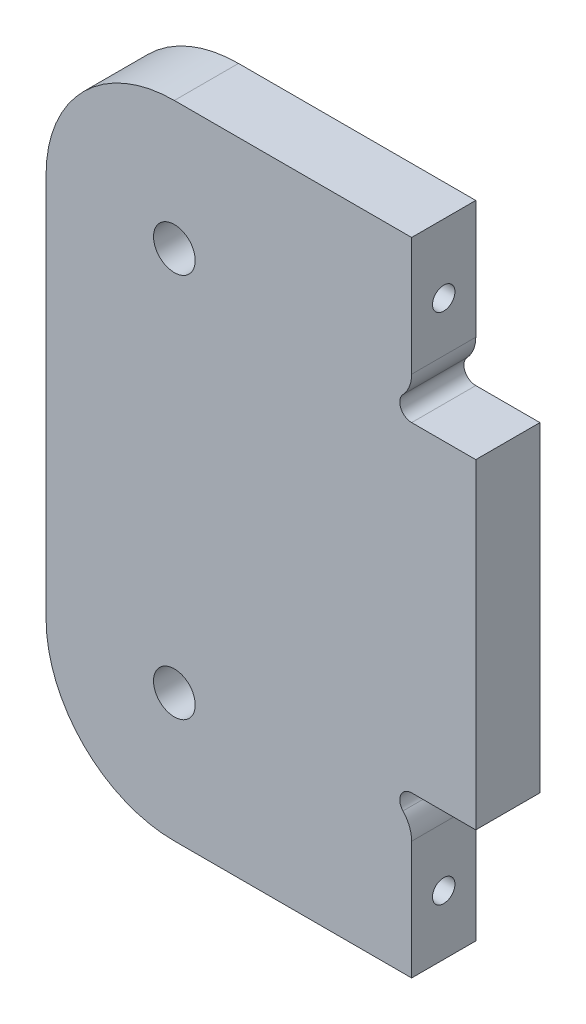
ISO-10303-21;
HEADER;
FILE_DESCRIPTION(('STEP AP214'),'2;1');
FILE_NAME('part.step','',(''),(''),'','','');
FILE_SCHEMA(('AUTOMOTIVE_DESIGN { 1 0 10303 214 1 1 1 1 }'));
ENDSEC;
DATA;
#1=APPLICATION_CONTEXT('core data for automotive mechanical design processes');
#2=APPLICATION_PROTOCOL_DEFINITION('international standard','automotive_design',2000,#1);
#3=PRODUCT_CONTEXT('',#1,'mechanical');
#4=PRODUCT('Part','Part','',(#3));
#5=PRODUCT_RELATED_PRODUCT_CATEGORY('part','',(#4));
#6=PRODUCT_DEFINITION_FORMATION('','',#4);
#7=PRODUCT_DEFINITION_CONTEXT('part definition',#1,'design');
#8=PRODUCT_DEFINITION('design','',#6,#7);
#9=PRODUCT_DEFINITION_SHAPE('','',#8);
#10=(LENGTH_UNIT() NAMED_UNIT(*) SI_UNIT(.MILLI.,.METRE.));
#11=(NAMED_UNIT(*) PLANE_ANGLE_UNIT() SI_UNIT($,.RADIAN.));
#12=(NAMED_UNIT(*) SI_UNIT($,.STERADIAN.) SOLID_ANGLE_UNIT());
#13=UNCERTAINTY_MEASURE_WITH_UNIT(LENGTH_MEASURE(1.E-05),#10,'distance_accuracy_value','');
#14=(GEOMETRIC_REPRESENTATION_CONTEXT(3) GLOBAL_UNCERTAINTY_ASSIGNED_CONTEXT((#13)) GLOBAL_UNIT_ASSIGNED_CONTEXT((#10,
#11,#12)) REPRESENTATION_CONTEXT('',''));
#15=CARTESIAN_POINT('',(0.,0.,0.));
#16=DIRECTION('',(0.,0.,1.));
#17=DIRECTION('',(1.,0.,0.));
#18=AXIS2_PLACEMENT_3D('',#15,#16,#17);
#19=CARTESIAN_POINT('',(22.6472089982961,-26.1557877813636,10.));
#20=DIRECTION('',(0.,0.,1.));
#21=DIRECTION('',(1.,0.,0.));
#22=AXIS2_PLACEMENT_3D('',#19,#20,#21);
#23=PLANE('',#22);
#24=CARTESIAN_POINT('',(-14.3527910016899,-29.3057877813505,10.));
#25=DIRECTION('',(0.,0.,1.));
#26=DIRECTION('',(1.,0.,0.));
#27=AXIS2_PLACEMENT_3D('',#24,#25,#26);
#28=CIRCLE('',#27,3.25);
#29=CARTESIAN_POINT('',(-11.1027910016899,-29.3057877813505,10.));
#30=VERTEX_POINT('',#29);
#31=EDGE_CURVE('E191',#30,#30,#28,.T.);
#32=ORIENTED_EDGE('',*,*,#31,.F.);
#33=EDGE_LOOP('',(#32));
#34=FACE_BOUND('',#33,.T.);
#35=CARTESIAN_POINT('',(22.6472089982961,-26.1557877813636,10.));
#36=DIRECTION('',(0.,0.,-1.));
#37=DIRECTION('',(1.,0.,0.));
#38=AXIS2_PLACEMENT_3D('',#35,#36,#37);
#39=CIRCLE('',#38,1.85000000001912);
#40=CARTESIAN_POINT('',(21.2968440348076,-27.4203092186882,10.));
#41=VERTEX_POINT('',#40);
#42=CARTESIAN_POINT('',(22.6472089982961,-24.3057877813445,10.));
#43=VERTEX_POINT('',#42);
#44=EDGE_CURVE('E227',#41,#43,#39,.T.);
#45=ORIENTED_EDGE('',*,*,#44,.T.);
#46=DIRECTION('',(1.,0.,0.));
#47=VECTOR('',#46,1.);
#48=CARTESIAN_POINT('',(22.6472089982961,-24.3057877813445,10.));
#49=LINE('',#48,#47);
#50=CARTESIAN_POINT('',(32.6472089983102,-24.3057877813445,10.));
#51=VERTEX_POINT('',#50);
#52=EDGE_CURVE('E125',#43,#51,#49,.T.);
#53=ORIENTED_EDGE('',*,*,#52,.T.);
#54=DIRECTION('',(0.,1.,0.));
#55=VECTOR('',#54,1.);
#56=CARTESIAN_POINT('',(32.6472089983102,-24.3057877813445,10.));
#57=LINE('',#56,#55);
#58=CARTESIAN_POINT('',(32.6472089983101,25.6942122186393,10.));
#59=VERTEX_POINT('',#58);
#60=EDGE_CURVE('E272',#51,#59,#57,.T.);
#61=ORIENTED_EDGE('',*,*,#60,.T.);
#62=DIRECTION('',(-1.,0.,0.));
#63=VECTOR('',#62,1.);
#64=CARTESIAN_POINT('',(32.6472089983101,25.6942122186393,10.));
#65=LINE('',#64,#63);
#66=CARTESIAN_POINT('',(22.6472089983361,25.6942122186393,10.));
#67=VERTEX_POINT('',#66);
#68=EDGE_CURVE('E292',#59,#67,#65,.T.);
#69=ORIENTED_EDGE('',*,*,#68,.T.);
#70=CARTESIAN_POINT('',(22.6472089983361,27.5442122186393,10.));
#71=DIRECTION('',(0.,0.,-1.));
#72=DIRECTION('',(1.,0.,0.));
#73=AXIS2_PLACEMENT_3D('',#70,#71,#72);
#74=CIRCLE('',#73,1.85000000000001);
#75=CARTESIAN_POINT('',(21.296844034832,28.8087336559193,10.));
#76=VERTEX_POINT('',#75);
#77=EDGE_CURVE('E288',#67,#76,#74,.T.);
#78=ORIENTED_EDGE('',*,*,#77,.T.);
#79=CARTESIAN_POINT('',(17.6472089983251,32.2263591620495,10.));
#80=DIRECTION('',(0.,0.,1.));
#81=DIRECTION('',(1.,0.,0.));
#82=AXIS2_PLACEMENT_3D('',#79,#80,#81);
#83=CIRCLE('',#82,4.99999999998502);
#84=CARTESIAN_POINT('',(22.6472089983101,32.2263591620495,10.));
#85=VERTEX_POINT('',#84);
#86=EDGE_CURVE('E291',#76,#85,#83,.T.);
#87=ORIENTED_EDGE('',*,*,#86,.T.);
#88=DIRECTION('',(0.,1.,0.));
#89=VECTOR('',#88,1.);
#90=CARTESIAN_POINT('',(22.6472089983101,32.2263591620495,10.));
#91=LINE('',#90,#89);
#92=CARTESIAN_POINT('',(22.6472089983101,50.6942122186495,10.));
#93=VERTEX_POINT('',#92);
#94=EDGE_CURVE('E296',#85,#93,#91,.T.);
#95=ORIENTED_EDGE('',*,*,#94,.T.);
#96=DIRECTION('',(-1.,0.,0.));
#97=VECTOR('',#96,1.);
#98=CARTESIAN_POINT('',(22.6472089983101,50.6942122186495,10.));
#99=LINE('',#98,#97);
#100=CARTESIAN_POINT('',(-14.3527910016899,50.6942122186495,10.));
#101=VERTEX_POINT('',#100);
#102=EDGE_CURVE('E303',#93,#101,#99,.T.);
#103=ORIENTED_EDGE('',*,*,#102,.T.);
#104=CARTESIAN_POINT('',(-14.3527910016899,30.6942122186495,10.));
#105=DIRECTION('',(0.,0.,1.));
#106=DIRECTION('',(1.,0.,0.));
#107=AXIS2_PLACEMENT_3D('',#104,#105,#106);
#108=CIRCLE('',#107,20.);
#109=CARTESIAN_POINT('',(-34.3527910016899,30.6942122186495,10.));
#110=VERTEX_POINT('',#109);
#111=EDGE_CURVE('E306',#101,#110,#108,.T.);
#112=ORIENTED_EDGE('',*,*,#111,.T.);
#113=DIRECTION('',(0.,-1.,0.));
#114=VECTOR('',#113,1.);
#115=CARTESIAN_POINT('',(-34.3527910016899,30.6942122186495,10.));
#116=LINE('',#115,#114);
#117=CARTESIAN_POINT('',(-34.3527910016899,-29.3057877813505,10.));
#118=VERTEX_POINT('',#117);
#119=EDGE_CURVE('E309',#110,#118,#116,.T.);
#120=ORIENTED_EDGE('',*,*,#119,.T.);
#121=CARTESIAN_POINT('',(-14.3527910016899,-29.3057877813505,10.));
#122=DIRECTION('',(0.,0.,1.));
#123=DIRECTION('',(1.,0.,0.));
#124=AXIS2_PLACEMENT_3D('',#121,#122,#123);
#125=CIRCLE('',#124,20.);
#126=CARTESIAN_POINT('',(-14.3527910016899,-49.3057877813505,10.));
#127=VERTEX_POINT('',#126);
#128=EDGE_CURVE('E164',#118,#127,#125,.T.);
#129=ORIENTED_EDGE('',*,*,#128,.T.);
#130=DIRECTION('',(1.,0.,0.));
#131=VECTOR('',#130,1.);
#132=CARTESIAN_POINT('',(-14.3527910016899,-49.3057877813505,10.));
#133=LINE('',#132,#131);
#134=CARTESIAN_POINT('',(22.6472089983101,-49.3057877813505,10.));
#135=VERTEX_POINT('',#134);
#136=EDGE_CURVE('E158',#127,#135,#133,.T.);
#137=ORIENTED_EDGE('',*,*,#136,.T.);
#138=DIRECTION('',(0.,1.,0.));
#139=VECTOR('',#138,1.);
#140=CARTESIAN_POINT('',(22.6472089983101,-49.3057877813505,10.));
#141=LINE('',#140,#139);
#142=CARTESIAN_POINT('',(22.6472089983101,-30.8379347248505,10.));
#143=VERTEX_POINT('',#142);
#144=EDGE_CURVE('E162',#135,#143,#141,.T.);
#145=ORIENTED_EDGE('',*,*,#144,.T.);
#146=CARTESIAN_POINT('',(17.6472089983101,-30.8379347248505,10.));
#147=DIRECTION('',(0.,0.,1.));
#148=DIRECTION('',(1.,0.,0.));
#149=AXIS2_PLACEMENT_3D('',#146,#147,#148);
#150=CIRCLE('',#149,5.00000000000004);
#151=EDGE_CURVE('E63',#143,#41,#150,.T.);
#152=ORIENTED_EDGE('',*,*,#151,.T.);
#153=EDGE_LOOP('',(#45,#53,#61,#69,#78,#87,#95,#103,#112,#120,#129,#137,#145,#152));
#154=FACE_BOUND('',#153,.T.);
#155=CARTESIAN_POINT('',(-14.3527910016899,30.6942122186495,10.));
#156=DIRECTION('',(0.,0.,1.));
#157=DIRECTION('',(1.,0.,0.));
#158=AXIS2_PLACEMENT_3D('',#155,#156,#157);
#159=CIRCLE('',#158,3.25);
#160=CARTESIAN_POINT('',(-11.1027910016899,30.6942122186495,10.));
#161=VERTEX_POINT('',#160);
#162=EDGE_CURVE('E390',#161,#161,#159,.T.);
#163=ORIENTED_EDGE('',*,*,#162,.F.);
#164=EDGE_LOOP('',(#163));
#165=FACE_BOUND('',#164,.T.);
#166=ADVANCED_FACE('F45',(#34,#154,#165),#23,.T.);
#167=CARTESIAN_POINT('',(22.6472089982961,-26.1557877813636,0.));
#168=DIRECTION('',(0.,0.,1.));
#169=DIRECTION('',(1.,0.,0.));
#170=AXIS2_PLACEMENT_3D('',#167,#168,#169);
#171=PLANE('',#170);
#172=CARTESIAN_POINT('',(22.6472089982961,-26.1557877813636,0.));
#173=DIRECTION('',(0.,0.,-1.));
#174=DIRECTION('',(1.,0.,0.));
#175=AXIS2_PLACEMENT_3D('',#172,#173,#174);
#176=CIRCLE('',#175,1.85000000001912);
#177=CARTESIAN_POINT('',(21.2968440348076,-27.4203092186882,0.));
#178=VERTEX_POINT('',#177);
#179=CARTESIAN_POINT('',(22.6472089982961,-24.3057877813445,0.));
#180=VERTEX_POINT('',#179);
#181=EDGE_CURVE('E186',#178,#180,#176,.T.);
#182=ORIENTED_EDGE('',*,*,#181,.F.);
#183=CARTESIAN_POINT('',(17.6472089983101,-30.8379347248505,0.));
#184=DIRECTION('',(0.,0.,1.));
#185=DIRECTION('',(1.,0.,0.));
#186=AXIS2_PLACEMENT_3D('',#183,#184,#185);
#187=CIRCLE('',#186,5.00000000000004);
#188=CARTESIAN_POINT('',(22.6472089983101,-30.8379347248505,0.));
#189=VERTEX_POINT('',#188);
#190=EDGE_CURVE('E117',#189,#178,#187,.T.);
#191=ORIENTED_EDGE('',*,*,#190,.F.);
#192=DIRECTION('',(0.,1.,0.));
#193=VECTOR('',#192,1.);
#194=CARTESIAN_POINT('',(22.6472089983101,-49.3057877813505,0.));
#195=LINE('',#194,#193);
#196=CARTESIAN_POINT('',(22.6472089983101,-49.3057877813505,0.));
#197=VERTEX_POINT('',#196);
#198=EDGE_CURVE('E111',#197,#189,#195,.T.);
#199=ORIENTED_EDGE('',*,*,#198,.F.);
#200=DIRECTION('',(1.,0.,0.));
#201=VECTOR('',#200,1.);
#202=CARTESIAN_POINT('',(-14.3527910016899,-49.3057877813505,0.));
#203=LINE('',#202,#201);
#204=CARTESIAN_POINT('',(-14.3527910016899,-49.3057877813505,0.));
#205=VERTEX_POINT('',#204);
#206=EDGE_CURVE('E173',#205,#197,#203,.T.);
#207=ORIENTED_EDGE('',*,*,#206,.F.);
#208=CARTESIAN_POINT('',(-14.3527910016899,-29.3057877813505,0.));
#209=DIRECTION('',(0.,0.,1.));
#210=DIRECTION('',(1.,0.,0.));
#211=AXIS2_PLACEMENT_3D('',#208,#209,#210);
#212=CIRCLE('',#211,20.);
#213=CARTESIAN_POINT('',(-34.3527910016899,-29.3057877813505,0.));
#214=VERTEX_POINT('',#213);
#215=EDGE_CURVE('E218',#214,#205,#212,.T.);
#216=ORIENTED_EDGE('',*,*,#215,.F.);
#217=DIRECTION('',(0.,-1.,0.));
#218=VECTOR('',#217,1.);
#219=CARTESIAN_POINT('',(-34.3527910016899,30.6942122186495,0.));
#220=LINE('',#219,#218);
#221=CARTESIAN_POINT('',(-34.3527910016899,30.6942122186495,0.));
#222=VERTEX_POINT('',#221);
#223=EDGE_CURVE('E215',#222,#214,#220,.T.);
#224=ORIENTED_EDGE('',*,*,#223,.F.);
#225=CARTESIAN_POINT('',(-14.3527910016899,30.6942122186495,0.));
#226=DIRECTION('',(0.,0.,1.));
#227=DIRECTION('',(1.,0.,0.));
#228=AXIS2_PLACEMENT_3D('',#225,#226,#227);
#229=CIRCLE('',#228,20.);
#230=CARTESIAN_POINT('',(-14.3527910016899,50.6942122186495,0.));
#231=VERTEX_POINT('',#230);
#232=EDGE_CURVE('E212',#231,#222,#229,.T.);
#233=ORIENTED_EDGE('',*,*,#232,.F.);
#234=DIRECTION('',(-1.,0.,0.));
#235=VECTOR('',#234,1.);
#236=CARTESIAN_POINT('',(22.6472089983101,50.6942122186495,0.));
#237=LINE('',#236,#235);
#238=CARTESIAN_POINT('',(22.6472089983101,50.6942122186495,0.));
#239=VERTEX_POINT('',#238);
#240=EDGE_CURVE('E209',#239,#231,#237,.T.);
#241=ORIENTED_EDGE('',*,*,#240,.F.);
#242=DIRECTION('',(0.,1.,0.));
#243=VECTOR('',#242,1.);
#244=CARTESIAN_POINT('',(22.6472089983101,32.2263591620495,0.));
#245=LINE('',#244,#243);
#246=CARTESIAN_POINT('',(22.6472089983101,32.2263591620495,0.));
#247=VERTEX_POINT('',#246);
#248=EDGE_CURVE('E206',#247,#239,#245,.T.);
#249=ORIENTED_EDGE('',*,*,#248,.F.);
#250=CARTESIAN_POINT('',(17.6472089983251,32.2263591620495,0.));
#251=DIRECTION('',(0.,0.,1.));
#252=DIRECTION('',(1.,0.,0.));
#253=AXIS2_PLACEMENT_3D('',#250,#251,#252);
#254=CIRCLE('',#253,4.99999999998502);
#255=CARTESIAN_POINT('',(21.296844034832,28.8087336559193,0.));
#256=VERTEX_POINT('',#255);
#257=EDGE_CURVE('E203',#256,#247,#254,.T.);
#258=ORIENTED_EDGE('',*,*,#257,.F.);
#259=CARTESIAN_POINT('',(22.6472089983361,27.5442122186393,0.));
#260=DIRECTION('',(0.,0.,-1.));
#261=DIRECTION('',(1.,0.,0.));
#262=AXIS2_PLACEMENT_3D('',#259,#260,#261);
#263=CIRCLE('',#262,1.85000000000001);
#264=CARTESIAN_POINT('',(22.6472089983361,25.6942122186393,0.));
#265=VERTEX_POINT('',#264);
#266=EDGE_CURVE('E200',#265,#256,#263,.T.);
#267=ORIENTED_EDGE('',*,*,#266,.F.);
#268=DIRECTION('',(-1.,0.,0.));
#269=VECTOR('',#268,1.);
#270=CARTESIAN_POINT('',(32.6472089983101,25.6942122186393,0.));
#271=LINE('',#270,#269);
#272=CARTESIAN_POINT('',(32.6472089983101,25.6942122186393,0.));
#273=VERTEX_POINT('',#272);
#274=EDGE_CURVE('E197',#273,#265,#271,.T.);
#275=ORIENTED_EDGE('',*,*,#274,.F.);
#276=DIRECTION('',(0.,1.,0.));
#277=VECTOR('',#276,1.);
#278=CARTESIAN_POINT('',(32.6472089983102,-24.3057877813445,0.));
#279=LINE('',#278,#277);
#280=CARTESIAN_POINT('',(32.6472089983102,-24.3057877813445,0.));
#281=VERTEX_POINT('',#280);
#282=EDGE_CURVE('E194',#281,#273,#279,.T.);
#283=ORIENTED_EDGE('',*,*,#282,.F.);
#284=DIRECTION('',(1.,0.,0.));
#285=VECTOR('',#284,1.);
#286=CARTESIAN_POINT('',(22.6472089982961,-24.3057877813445,0.));
#287=LINE('',#286,#285);
#288=EDGE_CURVE('E190',#180,#281,#287,.T.);
#289=ORIENTED_EDGE('',*,*,#288,.F.);
#290=EDGE_LOOP('',(#182,#191,#199,#207,#216,#224,#233,#241,#249,#258,#267,#275,#283,#289));
#291=FACE_BOUND('',#290,.T.);
#292=CARTESIAN_POINT('',(-14.3527910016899,-29.3057877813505,0.));
#293=DIRECTION('',(0.,0.,1.));
#294=DIRECTION('',(1.,0.,0.));
#295=AXIS2_PLACEMENT_3D('',#292,#293,#294);
#296=CIRCLE('',#295,3.25);
#297=CARTESIAN_POINT('',(-11.1027910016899,-29.3057877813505,0.));
#298=VERTEX_POINT('',#297);
#299=EDGE_CURVE('E394',#298,#298,#296,.T.);
#300=ORIENTED_EDGE('',*,*,#299,.T.);
#301=EDGE_LOOP('',(#300));
#302=FACE_BOUND('',#301,.T.);
#303=CARTESIAN_POINT('',(-14.3527910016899,30.6942122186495,0.));
#304=DIRECTION('',(0.,0.,1.));
#305=DIRECTION('',(1.,0.,0.));
#306=AXIS2_PLACEMENT_3D('',#303,#304,#305);
#307=CIRCLE('',#306,3.25);
#308=CARTESIAN_POINT('',(-11.1027910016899,30.6942122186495,0.));
#309=VERTEX_POINT('',#308);
#310=EDGE_CURVE('E389',#309,#309,#307,.T.);
#311=ORIENTED_EDGE('',*,*,#310,.T.);
#312=EDGE_LOOP('',(#311));
#313=FACE_BOUND('',#312,.T.);
#314=ADVANCED_FACE('F276',(#291,#302,#313),#171,.F.);
#315=CARTESIAN_POINT('',(22.6472089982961,-26.1557877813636,10.));
#316=DIRECTION('',(0.,0.,-1.));
#317=DIRECTION('',(-1.,0.,0.));
#318=AXIS2_PLACEMENT_3D('',#315,#316,#317);
#319=CYLINDRICAL_SURFACE('',#318,1.85000000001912);
#320=ORIENTED_EDGE('',*,*,#181,.T.);
#321=DIRECTION('',(0.,0.,-1.));
#322=VECTOR('',#321,1.);
#323=CARTESIAN_POINT('',(22.6472089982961,-24.3057877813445,10.));
#324=LINE('',#323,#322);
#325=EDGE_CURVE('E11',#43,#180,#324,.T.);
#326=ORIENTED_EDGE('',*,*,#325,.F.);
#327=ORIENTED_EDGE('',*,*,#44,.F.);
#328=DIRECTION('',(0.,0.,-1.));
#329=VECTOR('',#328,1.);
#330=CARTESIAN_POINT('',(21.2968440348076,-27.4203092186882,10.));
#331=LINE('',#330,#329);
#332=EDGE_CURVE('E182',#41,#178,#331,.T.);
#333=ORIENTED_EDGE('',*,*,#332,.T.);
#334=EDGE_LOOP('',(#320,#326,#327,#333));
#335=FACE_BOUND('',#334,.T.);
#336=ADVANCED_FACE('F47',(#335),#319,.F.);
#337=CARTESIAN_POINT('',(22.6472089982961,-24.3057877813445,10.));
#338=DIRECTION('',(0.,1.,0.));
#339=DIRECTION('',(-1.,0.,0.));
#340=AXIS2_PLACEMENT_3D('',#337,#338,#339);
#341=PLANE('',#340);
#342=ORIENTED_EDGE('',*,*,#288,.T.);
#343=DIRECTION('',(0.,0.,-1.));
#344=VECTOR('',#343,1.);
#345=CARTESIAN_POINT('',(32.6472089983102,-24.3057877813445,10.));
#346=LINE('',#345,#344);
#347=EDGE_CURVE('E55',#51,#281,#346,.T.);
#348=ORIENTED_EDGE('',*,*,#347,.F.);
#349=ORIENTED_EDGE('',*,*,#52,.F.);
#350=ORIENTED_EDGE('',*,*,#325,.T.);
#351=EDGE_LOOP('',(#342,#348,#349,#350));
#352=FACE_BOUND('',#351,.T.);
#353=ADVANCED_FACE('F454',(#352),#341,.F.);
#354=CARTESIAN_POINT('',(32.6472089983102,-24.3057877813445,10.));
#355=DIRECTION('',(-1.,0.,0.));
#356=DIRECTION('',(0.,-1.,0.));
#357=AXIS2_PLACEMENT_3D('',#354,#355,#356);
#358=PLANE('',#357);
#359=ORIENTED_EDGE('',*,*,#282,.T.);
#360=DIRECTION('',(0.,0.,-1.));
#361=VECTOR('',#360,1.);
#362=CARTESIAN_POINT('',(32.6472089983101,25.6942122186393,10.));
#363=LINE('',#362,#361);
#364=EDGE_CURVE('E262',#59,#273,#363,.T.);
#365=ORIENTED_EDGE('',*,*,#364,.F.);
#366=ORIENTED_EDGE('',*,*,#60,.F.);
#367=ORIENTED_EDGE('',*,*,#347,.T.);
#368=EDGE_LOOP('',(#359,#365,#366,#367));
#369=FACE_BOUND('',#368,.T.);
#370=ADVANCED_FACE('F270',(#369),#358,.F.);
#371=CARTESIAN_POINT('',(32.6472089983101,25.6942122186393,10.));
#372=DIRECTION('',(0.,-1.,0.));
#373=DIRECTION('',(1.,0.,0.));
#374=AXIS2_PLACEMENT_3D('',#371,#372,#373);
#375=PLANE('',#374);
#376=ORIENTED_EDGE('',*,*,#274,.T.);
#377=DIRECTION('',(0.,0.,-1.));
#378=VECTOR('',#377,1.);
#379=CARTESIAN_POINT('',(22.6472089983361,25.6942122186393,10.));
#380=LINE('',#379,#378);
#381=EDGE_CURVE('E258',#67,#265,#380,.T.);
#382=ORIENTED_EDGE('',*,*,#381,.F.);
#383=ORIENTED_EDGE('',*,*,#68,.F.);
#384=ORIENTED_EDGE('',*,*,#364,.T.);
#385=EDGE_LOOP('',(#376,#382,#383,#384));
#386=FACE_BOUND('',#385,.T.);
#387=ADVANCED_FACE('F282',(#386),#375,.F.);
#388=CARTESIAN_POINT('',(22.6472089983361,27.5442122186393,10.));
#389=DIRECTION('',(0.,0.,-1.));
#390=DIRECTION('',(-1.,0.,0.));
#391=AXIS2_PLACEMENT_3D('',#388,#389,#390);
#392=CYLINDRICAL_SURFACE('',#391,1.85000000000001);
#393=ORIENTED_EDGE('',*,*,#266,.T.);
#394=DIRECTION('',(0.,0.,-1.));
#395=VECTOR('',#394,1.);
#396=CARTESIAN_POINT('',(21.296844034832,28.8087336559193,10.));
#397=LINE('',#396,#395);
#398=EDGE_CURVE('E254',#76,#256,#397,.T.);
#399=ORIENTED_EDGE('',*,*,#398,.F.);
#400=ORIENTED_EDGE('',*,*,#77,.F.);
#401=ORIENTED_EDGE('',*,*,#381,.T.);
#402=EDGE_LOOP('',(#393,#399,#400,#401));
#403=FACE_BOUND('',#402,.T.);
#404=ADVANCED_FACE('F286',(#403),#392,.F.);
#405=CARTESIAN_POINT('',(17.6472089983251,32.2263591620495,10.));
#406=DIRECTION('',(0.,0.,-1.));
#407=DIRECTION('',(-1.,0.,0.));
#408=AXIS2_PLACEMENT_3D('',#405,#406,#407);
#409=CYLINDRICAL_SURFACE('',#408,4.99999999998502);
#410=ORIENTED_EDGE('',*,*,#257,.T.);
#411=DIRECTION('',(0.,0.,-1.));
#412=VECTOR('',#411,1.);
#413=CARTESIAN_POINT('',(22.6472089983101,32.2263591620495,10.));
#414=LINE('',#413,#412);
#415=EDGE_CURVE('E250',#85,#247,#414,.T.);
#416=ORIENTED_EDGE('',*,*,#415,.F.);
#417=ORIENTED_EDGE('',*,*,#86,.F.);
#418=ORIENTED_EDGE('',*,*,#398,.T.);
#419=EDGE_LOOP('',(#410,#416,#417,#418));
#420=FACE_BOUND('',#419,.T.);
#421=ADVANCED_FACE('F423',(#420),#409,.T.);
#422=CARTESIAN_POINT('',(22.6472089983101,32.2263591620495,10.));
#423=DIRECTION('',(-1.,0.,0.));
#424=DIRECTION('',(0.,0.,1.));
#425=AXIS2_PLACEMENT_3D('',#422,#423,#424);
#426=PLANE('',#425);
#427=CARTESIAN_POINT('',(22.6472089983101,40.,5.));
#428=DIRECTION('',(1.,0.,0.));
#429=DIRECTION('',(0.,0.,-1.));
#430=AXIS2_PLACEMENT_3D('',#427,#428,#429);
#431=CIRCLE('',#430,1.74999999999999);
#432=CARTESIAN_POINT('',(22.6472089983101,40.,3.25000000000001));
#433=VERTEX_POINT('',#432);
#434=EDGE_CURVE('E374',#433,#433,#431,.T.);
#435=ORIENTED_EDGE('',*,*,#434,.F.);
#436=EDGE_LOOP('',(#435));
#437=FACE_BOUND('',#436,.T.);
#438=ORIENTED_EDGE('',*,*,#248,.T.);
#439=DIRECTION('',(0.,0.,-1.));
#440=VECTOR('',#439,1.);
#441=CARTESIAN_POINT('',(22.6472089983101,50.6942122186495,10.));
#442=LINE('',#441,#440);
#443=EDGE_CURVE('E246',#93,#239,#442,.T.);
#444=ORIENTED_EDGE('',*,*,#443,.F.);
#445=ORIENTED_EDGE('',*,*,#94,.F.);
#446=ORIENTED_EDGE('',*,*,#415,.T.);
#447=EDGE_LOOP('',(#438,#444,#445,#446));
#448=FACE_BOUND('',#447,.T.);
#449=ADVANCED_FACE('F419',(#437,#448),#426,.F.);
#450=CARTESIAN_POINT('',(22.6472089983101,50.6942122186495,10.));
#451=DIRECTION('',(0.,-1.,0.));
#452=DIRECTION('',(0.,0.,-1.));
#453=AXIS2_PLACEMENT_3D('',#450,#451,#452);
#454=PLANE('',#453);
#455=ORIENTED_EDGE('',*,*,#240,.T.);
#456=DIRECTION('',(0.,0.,-1.));
#457=VECTOR('',#456,1.);
#458=CARTESIAN_POINT('',(-14.3527910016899,50.6942122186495,10.));
#459=LINE('',#458,#457);
#460=EDGE_CURVE('E242',#101,#231,#459,.T.);
#461=ORIENTED_EDGE('',*,*,#460,.F.);
#462=ORIENTED_EDGE('',*,*,#102,.F.);
#463=ORIENTED_EDGE('',*,*,#443,.T.);
#464=EDGE_LOOP('',(#455,#461,#462,#463));
#465=FACE_BOUND('',#464,.T.);
#466=ADVANCED_FACE('F422',(#465),#454,.F.);
#467=CARTESIAN_POINT('',(-14.3527910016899,30.6942122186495,10.));
#468=DIRECTION('',(0.,0.,-1.));
#469=DIRECTION('',(-1.,0.,0.));
#470=AXIS2_PLACEMENT_3D('',#467,#468,#469);
#471=CYLINDRICAL_SURFACE('',#470,20.);
#472=ORIENTED_EDGE('',*,*,#232,.T.);
#473=DIRECTION('',(0.,0.,-1.));
#474=VECTOR('',#473,1.);
#475=CARTESIAN_POINT('',(-34.3527910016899,30.6942122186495,10.));
#476=LINE('',#475,#474);
#477=EDGE_CURVE('E238',#110,#222,#476,.T.);
#478=ORIENTED_EDGE('',*,*,#477,.F.);
#479=ORIENTED_EDGE('',*,*,#111,.F.);
#480=ORIENTED_EDGE('',*,*,#460,.T.);
#481=EDGE_LOOP('',(#472,#478,#479,#480));
#482=FACE_BOUND('',#481,.T.);
#483=ADVANCED_FACE('F435',(#482),#471,.T.);
#484=CARTESIAN_POINT('',(-34.3527910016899,30.6942122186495,10.));
#485=DIRECTION('',(1.,0.,0.));
#486=DIRECTION('',(0.,0.,-1.));
#487=AXIS2_PLACEMENT_3D('',#484,#485,#486);
#488=PLANE('',#487);
#489=ORIENTED_EDGE('',*,*,#223,.T.);
#490=DIRECTION('',(0.,0.,-1.));
#491=VECTOR('',#490,1.);
#492=CARTESIAN_POINT('',(-34.3527910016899,-29.3057877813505,10.));
#493=LINE('',#492,#491);
#494=EDGE_CURVE('E234',#118,#214,#493,.T.);
#495=ORIENTED_EDGE('',*,*,#494,.F.);
#496=ORIENTED_EDGE('',*,*,#119,.F.);
#497=ORIENTED_EDGE('',*,*,#477,.T.);
#498=EDGE_LOOP('',(#489,#495,#496,#497));
#499=FACE_BOUND('',#498,.T.);
#500=ADVANCED_FACE('F317',(#499),#488,.F.);
#501=CARTESIAN_POINT('',(-14.3527910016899,-29.3057877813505,10.));
#502=DIRECTION('',(0.,0.,-1.));
#503=DIRECTION('',(-1.,0.,0.));
#504=AXIS2_PLACEMENT_3D('',#501,#502,#503);
#505=CYLINDRICAL_SURFACE('',#504,20.);
#506=ORIENTED_EDGE('',*,*,#215,.T.);
#507=DIRECTION('',(0.,0.,-1.));
#508=VECTOR('',#507,1.);
#509=CARTESIAN_POINT('',(-14.3527910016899,-49.3057877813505,10.));
#510=LINE('',#509,#508);
#511=EDGE_CURVE('E175',#127,#205,#510,.T.);
#512=ORIENTED_EDGE('',*,*,#511,.F.);
#513=ORIENTED_EDGE('',*,*,#128,.F.);
#514=ORIENTED_EDGE('',*,*,#494,.T.);
#515=EDGE_LOOP('',(#506,#512,#513,#514));
#516=FACE_BOUND('',#515,.T.);
#517=ADVANCED_FACE('F321',(#516),#505,.T.);
#518=CARTESIAN_POINT('',(-14.3527910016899,-49.3057877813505,10.));
#519=DIRECTION('',(0.,1.,0.));
#520=DIRECTION('',(0.,0.,1.));
#521=AXIS2_PLACEMENT_3D('',#518,#519,#520);
#522=PLANE('',#521);
#523=ORIENTED_EDGE('',*,*,#206,.T.);
#524=DIRECTION('',(0.,0.,-1.));
#525=VECTOR('',#524,1.);
#526=CARTESIAN_POINT('',(22.6472089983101,-49.3057877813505,10.));
#527=LINE('',#526,#525);
#528=EDGE_CURVE('E170',#135,#197,#527,.T.);
#529=ORIENTED_EDGE('',*,*,#528,.F.);
#530=ORIENTED_EDGE('',*,*,#136,.F.);
#531=ORIENTED_EDGE('',*,*,#511,.T.);
#532=EDGE_LOOP('',(#523,#529,#530,#531));
#533=FACE_BOUND('',#532,.T.);
#534=ADVANCED_FACE('F171',(#533),#522,.F.);
#535=CARTESIAN_POINT('',(22.6472089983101,-49.3057877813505,10.));
#536=DIRECTION('',(-1.,0.,0.));
#537=DIRECTION('',(0.,0.,1.));
#538=AXIS2_PLACEMENT_3D('',#535,#536,#537);
#539=PLANE('',#538);
#540=CARTESIAN_POINT('',(22.6472089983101,-40.0021838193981,5.));
#541=DIRECTION('',(1.,0.,0.));
#542=DIRECTION('',(0.,0.,-1.));
#543=AXIS2_PLACEMENT_3D('',#540,#541,#542);
#544=CIRCLE('',#543,1.74999999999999);
#545=CARTESIAN_POINT('',(22.6472089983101,-40.0021838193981,3.25000000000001));
#546=VERTEX_POINT('',#545);
#547=EDGE_CURVE('E379',#546,#546,#544,.T.);
#548=ORIENTED_EDGE('',*,*,#547,.F.);
#549=EDGE_LOOP('',(#548));
#550=FACE_BOUND('',#549,.T.);
#551=ORIENTED_EDGE('',*,*,#198,.T.);
#552=DIRECTION('',(0.,0.,-1.));
#553=VECTOR('',#552,1.);
#554=CARTESIAN_POINT('',(22.6472089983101,-30.8379347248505,10.));
#555=LINE('',#554,#553);
#556=EDGE_CURVE('E176',#143,#189,#555,.T.);
#557=ORIENTED_EDGE('',*,*,#556,.F.);
#558=ORIENTED_EDGE('',*,*,#144,.F.);
#559=ORIENTED_EDGE('',*,*,#528,.T.);
#560=EDGE_LOOP('',(#551,#557,#558,#559));
#561=FACE_BOUND('',#560,.T.);
#562=ADVANCED_FACE('F178',(#550,#561),#539,.F.);
#563=CARTESIAN_POINT('',(17.6472089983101,-30.8379347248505,10.));
#564=DIRECTION('',(0.,0.,-1.));
#565=DIRECTION('',(-1.,0.,0.));
#566=AXIS2_PLACEMENT_3D('',#563,#564,#565);
#567=CYLINDRICAL_SURFACE('',#566,5.00000000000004);
#568=ORIENTED_EDGE('',*,*,#190,.T.);
#569=ORIENTED_EDGE('',*,*,#332,.F.);
#570=ORIENTED_EDGE('',*,*,#151,.F.);
#571=ORIENTED_EDGE('',*,*,#556,.T.);
#572=EDGE_LOOP('',(#568,#569,#570,#571));
#573=FACE_BOUND('',#572,.T.);
#574=ADVANCED_FACE('F325',(#573),#567,.T.);
#575=CARTESIAN_POINT('',(-14.3527910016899,-29.3057877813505,10.));
#576=DIRECTION('',(0.,0.,-1.));
#577=DIRECTION('',(-1.,0.,0.));
#578=AXIS2_PLACEMENT_3D('',#575,#576,#577);
#579=CYLINDRICAL_SURFACE('',#578,3.25);
#580=ORIENTED_EDGE('',*,*,#31,.T.);
#581=EDGE_LOOP('',(#580));
#582=FACE_BOUND('',#581,.T.);
#583=ORIENTED_EDGE('',*,*,#299,.F.);
#584=EDGE_LOOP('',(#583));
#585=FACE_BOUND('',#584,.T.);
#586=ADVANCED_FACE('F327',(#582,#585),#579,.F.);
#587=CARTESIAN_POINT('',(-14.3527910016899,30.6942122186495,10.));
#588=DIRECTION('',(0.,0.,-1.));
#589=DIRECTION('',(-1.,0.,0.));
#590=AXIS2_PLACEMENT_3D('',#587,#588,#589);
#591=CYLINDRICAL_SURFACE('',#590,3.25);
#592=ORIENTED_EDGE('',*,*,#162,.T.);
#593=EDGE_LOOP('',(#592));
#594=FACE_BOUND('',#593,.T.);
#595=ORIENTED_EDGE('',*,*,#310,.F.);
#596=EDGE_LOOP('',(#595));
#597=FACE_BOUND('',#596,.T.);
#598=ADVANCED_FACE('F333',(#594,#597),#591,.F.);
#599=CARTESIAN_POINT('',(8.64720899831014,-40.0021838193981,5.));
#600=DIRECTION('',(1.,0.,0.));
#601=DIRECTION('',(0.,0.,-1.));
#602=AXIS2_PLACEMENT_3D('',#599,#600,#601);
#603=CONICAL_SURFACE('',#602,1.74999999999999,1.02974425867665);
#604=CARTESIAN_POINT('',(7.59570291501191,-40.0021838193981,5.));
#605=VERTEX_POINT('',#604);
#606=VERTEX_LOOP('',#605);
#607=FACE_BOUND('',#606,.T.);
#608=CARTESIAN_POINT('',(8.64720899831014,-40.0021838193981,5.));
#609=DIRECTION('',(1.,0.,0.));
#610=DIRECTION('',(0.,0.,-1.));
#611=AXIS2_PLACEMENT_3D('',#608,#609,#610);
#612=CIRCLE('',#611,1.74999999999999);
#613=CARTESIAN_POINT('',(8.64720899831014,-40.0021838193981,3.25000000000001));
#614=VERTEX_POINT('',#613);
#615=EDGE_CURVE('E385',#614,#614,#612,.T.);
#616=ORIENTED_EDGE('',*,*,#615,.T.);
#617=EDGE_LOOP('',(#616));
#618=FACE_BOUND('',#617,.T.);
#619=ADVANCED_FACE('F350',(#607,#618),#603,.F.);
#620=CARTESIAN_POINT('',(22.6472089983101,-40.0021838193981,5.));
#621=DIRECTION('',(1.,0.,0.));
#622=DIRECTION('',(0.,0.,-1.));
#623=AXIS2_PLACEMENT_3D('',#620,#621,#622);
#624=CYLINDRICAL_SURFACE('',#623,1.74999999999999);
#625=ORIENTED_EDGE('',*,*,#615,.F.);
#626=EDGE_LOOP('',(#625));
#627=FACE_BOUND('',#626,.T.);
#628=ORIENTED_EDGE('',*,*,#547,.T.);
#629=EDGE_LOOP('',(#628));
#630=FACE_BOUND('',#629,.T.);
#631=ADVANCED_FACE('F354',(#627,#630),#624,.F.);
#632=CARTESIAN_POINT('',(8.64720899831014,40.,5.));
#633=DIRECTION('',(1.,0.,0.));
#634=DIRECTION('',(0.,0.,-1.));
#635=AXIS2_PLACEMENT_3D('',#632,#633,#634);
#636=CONICAL_SURFACE('',#635,1.74999999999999,1.02974425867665);
#637=CARTESIAN_POINT('',(7.59570291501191,40.,5.));
#638=VERTEX_POINT('',#637);
#639=VERTEX_LOOP('',#638);
#640=FACE_BOUND('',#639,.T.);
#641=CARTESIAN_POINT('',(8.64720899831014,40.,5.));
#642=DIRECTION('',(1.,0.,0.));
#643=DIRECTION('',(0.,0.,-1.));
#644=AXIS2_PLACEMENT_3D('',#641,#642,#643);
#645=CIRCLE('',#644,1.74999999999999);
#646=CARTESIAN_POINT('',(8.64720899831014,40.,3.25000000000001));
#647=VERTEX_POINT('',#646);
#648=EDGE_CURVE('E371',#647,#647,#645,.T.);
#649=ORIENTED_EDGE('',*,*,#648,.T.);
#650=EDGE_LOOP('',(#649));
#651=FACE_BOUND('',#650,.T.);
#652=ADVANCED_FACE('F358',(#640,#651),#636,.F.);
#653=CARTESIAN_POINT('',(22.6472089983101,40.,5.));
#654=DIRECTION('',(1.,0.,0.));
#655=DIRECTION('',(0.,0.,-1.));
#656=AXIS2_PLACEMENT_3D('',#653,#654,#655);
#657=CYLINDRICAL_SURFACE('',#656,1.74999999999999);
#658=ORIENTED_EDGE('',*,*,#648,.F.);
#659=EDGE_LOOP('',(#658));
#660=FACE_BOUND('',#659,.T.);
#661=ORIENTED_EDGE('',*,*,#434,.T.);
#662=EDGE_LOOP('',(#661));
#663=FACE_BOUND('',#662,.T.);
#664=ADVANCED_FACE('F362',(#660,#663),#657,.F.);
#665=CLOSED_SHELL('',(#166,#314,#336,#353,#370,#387,#404,#421,#449,#466,#483,#500,#517,#534,
#562,#574,#586,#598,#619,#631,#652,#664));
#666=MANIFOLD_SOLID_BREP('B2',#665);
#667=ADVANCED_BREP_SHAPE_REPRESENTATION('',(#18,#666),#14);
#668=SHAPE_DEFINITION_REPRESENTATION(#9,#667);
ENDSEC;
END-ISO-10303-21;
